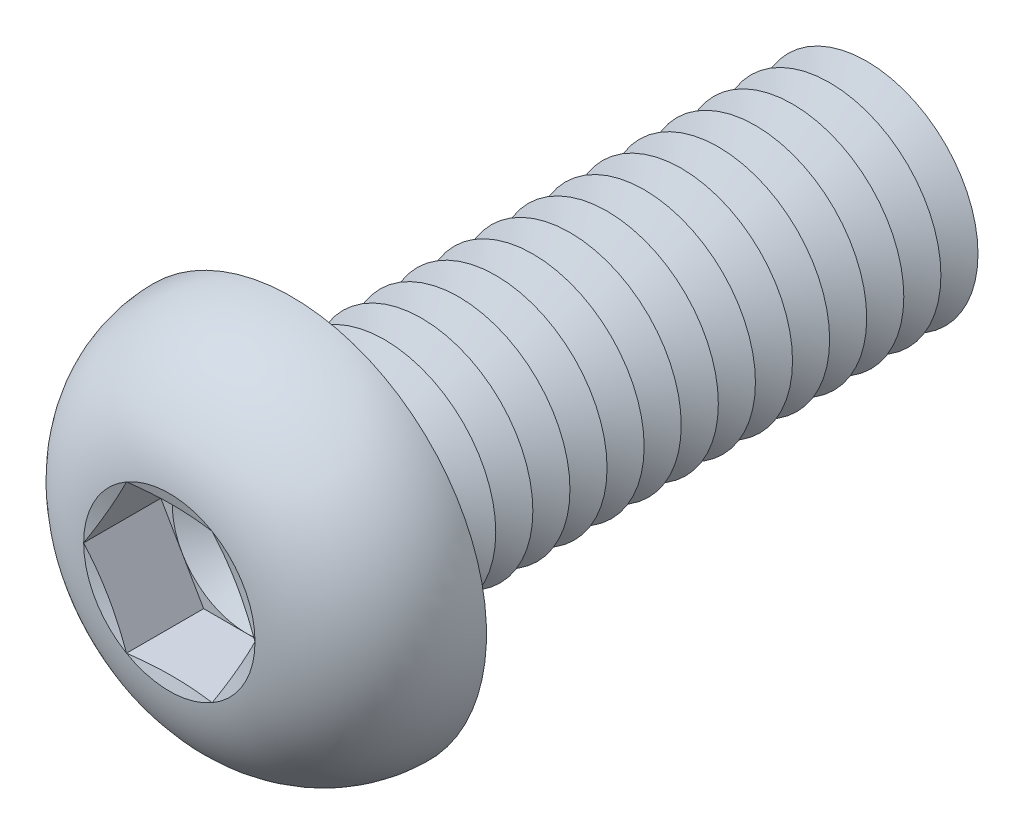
from build123d import *

# Parameters (mm, degrees)
FILLET1_R          = 0.5
LPATTERN1_COUNT    = 16
LPATTERN1_PITCH    = 1
CUT_EXTRUDE1_DEPTH = 2.08


with BuildPart() as part:
    # Sketch1 → Revolve1 (revolve)
    with BuildSketch(Plane(origin=(0, 0, 0), x_dir=(0, 0, -1), z_dir=(1, 0, 0)), mode=Mode.PRIVATE) as revolve1_sk:
        with BuildLine():
            Line((0, 3), (0, 5.25))
            ThreePointArc((0, 5.25), (-2.210041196, 4.408189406), (-3.3, 2.3094))
            Line((-3.3, 2.3094), (-2.990599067, 1.1547))
            Line((-2.990599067, 1.1547), (-3.3, 1.1547))
            Line((-3.3, 1.1547), (-3.3, 0))
            Line((-3.3, 0), (16, 0))
            Line((16, 0), (16, 3))
            Line((16, 3), (0, 3))
        make_face()
    revolve(revolve1_sk.sketch.rotate(Axis((0, 0, -16), (0, 0, 1)), 90), axis=Axis((0, 0, -16), (0, 0, 1)))

    # Fillet1
    fillet1_edges = [part.edges().sort_by_distance(p)[0] for p in [
        (3, 0, 0),
    ]]
    fillet(fillet1_edges, radius=FILLET1_R)

    # Sketch2 → Cut-Revolve1 (revolve, cut)
    with BuildSketch(Plane(origin=(0, 0, 0), x_dir=(0, 0, -1), z_dir=(1, 0, 0)), mode=Mode.PRIVATE) as cut_revolve1_sk:
        Polygon((15.5, 3), (16.5, 3), (16, 2.133974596), align=None)
    cut_revolve1 = revolve(cut_revolve1_sk.sketch.rotate(Axis((0, 0, -16), (0, 0, -1)), 270), axis=Axis((0, 0, -16), (0, 0, -1)), mode=Mode.SUBTRACT)

    # LPattern1: Cut-Revolve1 ×16
    with Locations(*[(0, 0, i * LPATTERN1_PITCH) for i in range(1, LPATTERN1_COUNT)]):
        add(cut_revolve1, mode=Mode.SUBTRACT)

    # Sketch3 → Cut-Extrude1 (cut)
    with BuildSketch(Plane.XY.offset(3.3)):
        Polygon((1.1547, 1.999999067), (-1.1547, 1.999999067), (-2.3094, 0), (-1.1547, -1.999999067), (1.1547, -1.999999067), (2.3094, 0), align=None)
    extrude(amount=-CUT_EXTRUDE1_DEPTH, mode=Mode.SUBTRACT)

    # Cut-Extrude2 cone 1 section (on through the dimple's axis) → Cut-Extrude2 (revolve, cut)
    with BuildSketch(Plane(origin=(0, 0, 1.22), x_dir=(0, -1, 0), z_dir=(1, 0, 0))):
        Polygon((0, 0), (1.999999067, 0), (0, 1.1547), align=None)
    revolve(axis=Axis((0, 0, 1.22), (0, 0, -1)), mode=Mode.SUBTRACT)


solid = part.part
